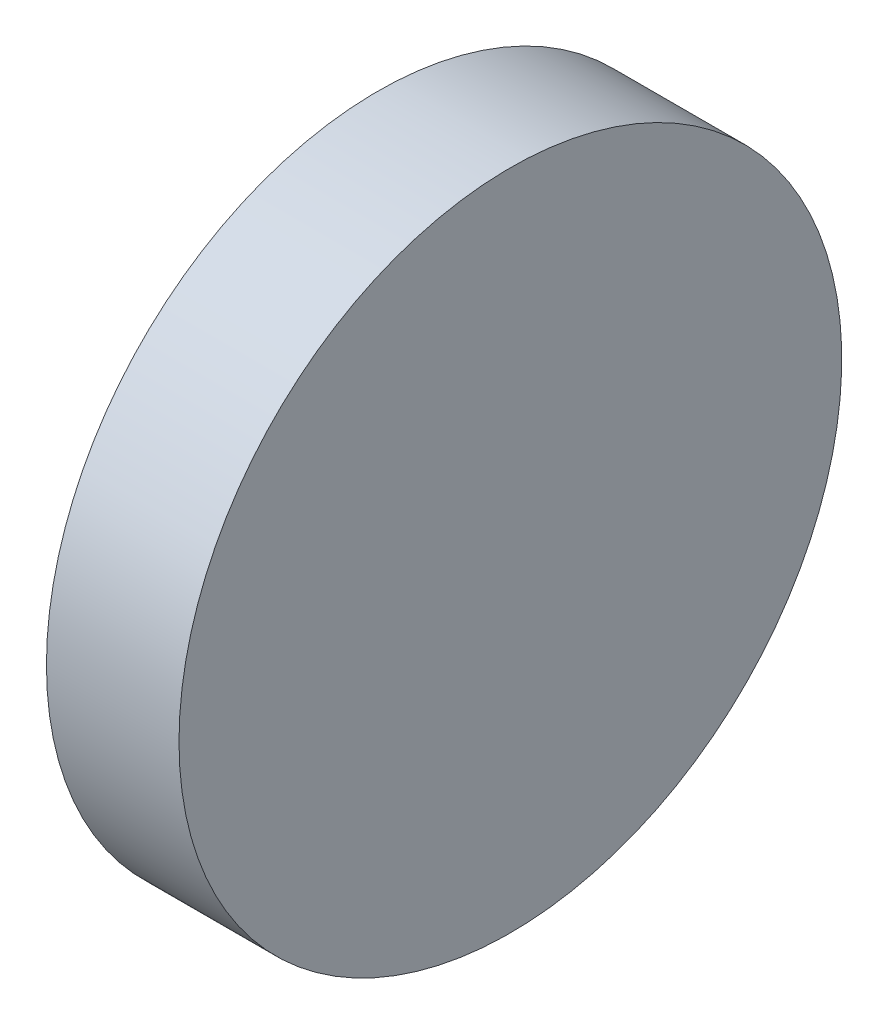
from build123d import *

# Parameters (mm, degrees)
SKETCH1_W = 12.7
SKETCH1_H = 31.75


with BuildPart() as part:
    # Sketch1 → Revolve1 (revolve)
    with BuildSketch(Plane(origin=(0, 0, 0), x_dir=(1, 0, 0), z_dir=(0, 1, 0)), mode=Mode.PRIVATE) as revolve1_sk:
        with Locations((6.35, 15.875)):
            Rectangle(SKETCH1_W, SKETCH1_H)
    revolve(revolve1_sk.sketch.rotate(Axis((0, 0, 0), (1, 0, 0)), 180), axis=Axis((0, 0, 0), (1, 0, 0)))


solid = part.part
